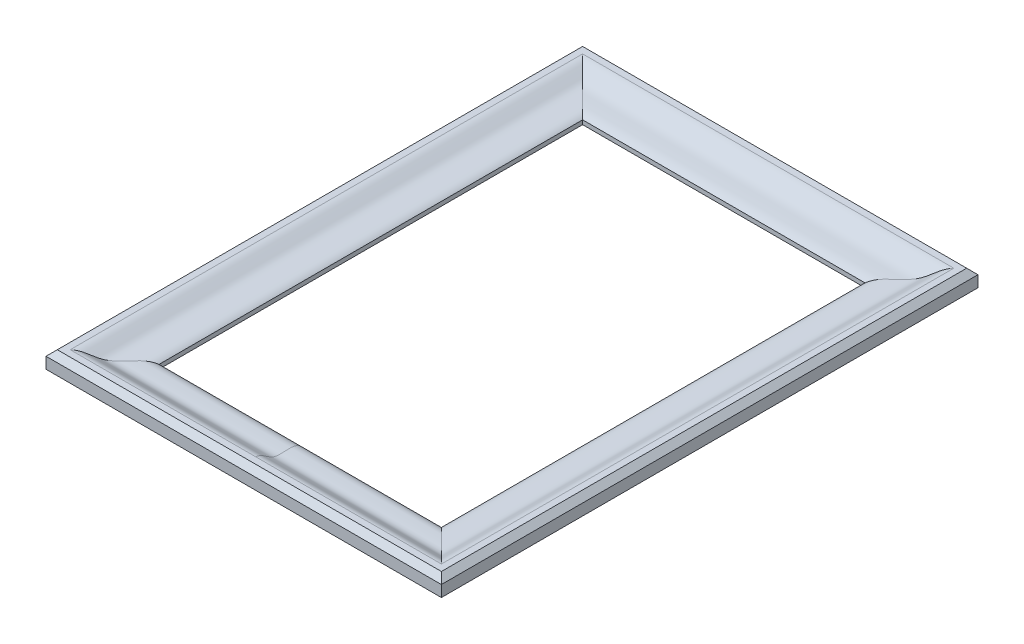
ISO-10303-21;
HEADER;
FILE_DESCRIPTION(('STEP AP214'),'2;1');
FILE_NAME('part.step','',(''),(''),'','','');
FILE_SCHEMA(('AUTOMOTIVE_DESIGN { 1 0 10303 214 1 1 1 1 }'));
ENDSEC;
DATA;
#1=APPLICATION_CONTEXT('core data for automotive mechanical design processes');
#2=APPLICATION_PROTOCOL_DEFINITION('international standard','automotive_design',2000,#1);
#3=PRODUCT_CONTEXT('',#1,'mechanical');
#4=PRODUCT('Part','Part','',(#3));
#5=PRODUCT_RELATED_PRODUCT_CATEGORY('part','',(#4));
#6=PRODUCT_DEFINITION_FORMATION('','',#4);
#7=PRODUCT_DEFINITION_CONTEXT('part definition',#1,'design');
#8=PRODUCT_DEFINITION('design','',#6,#7);
#9=PRODUCT_DEFINITION_SHAPE('','',#8);
#10=(LENGTH_UNIT() NAMED_UNIT(*) SI_UNIT(.MILLI.,.METRE.));
#11=(NAMED_UNIT(*) PLANE_ANGLE_UNIT() SI_UNIT($,.RADIAN.));
#12=(NAMED_UNIT(*) SI_UNIT($,.STERADIAN.) SOLID_ANGLE_UNIT());
#13=UNCERTAINTY_MEASURE_WITH_UNIT(LENGTH_MEASURE(1.E-05),#10,'distance_accuracy_value','');
#14=(GEOMETRIC_REPRESENTATION_CONTEXT(3) GLOBAL_UNCERTAINTY_ASSIGNED_CONTEXT((#13)) GLOBAL_UNIT_ASSIGNED_CONTEXT((#10,
#11,#12)) REPRESENTATION_CONTEXT('',''));
#15=CARTESIAN_POINT('',(0.,0.,0.));
#16=DIRECTION('',(0.,0.,1.));
#17=DIRECTION('',(1.,0.,0.));
#18=AXIS2_PLACEMENT_3D('',#15,#16,#17);
#19=CARTESIAN_POINT('',(0.,1.49398782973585,0.));
#20=DIRECTION('',(0.,0.,-1.));
#21=DIRECTION('',(0.,-1.,0.));
#22=AXIS2_PLACEMENT_3D('',#19,#20,#21);
#23=PLANE('',#22);
#24=DIRECTION('',(-1.,0.,0.));
#25=VECTOR('',#24,1.);
#26=CARTESIAN_POINT('',(-25.,1.49398782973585,0.));
#27=LINE('',#26,#25);
#28=CARTESIAN_POINT('',(0.,1.49398782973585,0.));
#29=VERTEX_POINT('',#28);
#30=CARTESIAN_POINT('',(-50.,1.49398782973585,0.));
#31=VERTEX_POINT('',#30);
#32=EDGE_CURVE('E224',#29,#31,#27,.T.);
#33=ORIENTED_EDGE('',*,*,#32,.F.);
#34=DIRECTION('',(-1.,0.,0.));
#35=VECTOR('',#34,1.);
#36=CARTESIAN_POINT('',(25.,1.49398782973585,0.));
#37=LINE('',#36,#35);
#38=CARTESIAN_POINT('',(50.,1.49398782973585,0.));
#39=VERTEX_POINT('',#38);
#40=EDGE_CURVE('E217',#39,#29,#37,.T.);
#41=ORIENTED_EDGE('',*,*,#40,.F.);
#42=DIRECTION('',(0.,-1.,0.));
#43=VECTOR('',#42,1.);
#44=CARTESIAN_POINT('',(50.,0.746993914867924,0.));
#45=LINE('',#44,#43);
#46=CARTESIAN_POINT('',(50.,0.,0.));
#47=VERTEX_POINT('',#46);
#48=EDGE_CURVE('E194',#39,#47,#45,.T.);
#49=ORIENTED_EDGE('',*,*,#48,.T.);
#50=DIRECTION('',(-1.,0.,0.));
#51=VECTOR('',#50,1.);
#52=CARTESIAN_POINT('',(-25.,0.,0.));
#53=LINE('',#52,#51);
#54=CARTESIAN_POINT('',(-50.,0.,0.));
#55=VERTEX_POINT('',#54);
#56=EDGE_CURVE('E303',#47,#55,#53,.T.);
#57=ORIENTED_EDGE('',*,*,#56,.T.);
#58=DIRECTION('',(0.,-1.,0.));
#59=VECTOR('',#58,1.);
#60=CARTESIAN_POINT('',(-50.,0.746993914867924,0.));
#61=LINE('',#60,#59);
#62=EDGE_CURVE('E296',#31,#55,#61,.T.);
#63=ORIENTED_EDGE('',*,*,#62,.F.);
#64=EDGE_LOOP('',(#33,#41,#49,#57,#63));
#65=FACE_BOUND('',#64,.T.);
#66=ADVANCED_FACE('F95',(#65),#23,.T.);
#67=CARTESIAN_POINT('',(0.,0.,0.));
#68=DIRECTION('',(0.,-1.,0.));
#69=DIRECTION('',(0.,0.,1.));
#70=AXIS2_PLACEMENT_3D('',#67,#68,#69);
#71=PLANE('',#70);
#72=DIRECTION('',(1.,0.,0.));
#73=VECTOR('',#72,1.);
#74=CARTESIAN_POINT('',(0.,0.,-170.));
#75=LINE('',#74,#73);
#76=CARTESIAN_POINT('',(-70.,0.,-170.));
#77=VERTEX_POINT('',#76);
#78=CARTESIAN_POINT('',(70.,0.,-170.));
#79=VERTEX_POINT('',#78);
#80=EDGE_CURVE('E255',#77,#79,#75,.T.);
#81=ORIENTED_EDGE('',*,*,#80,.T.);
#82=DIRECTION('',(0.,0.,1.));
#83=VECTOR('',#82,1.);
#84=CARTESIAN_POINT('',(70.,0.,-75.));
#85=LINE('',#84,#83);
#86=CARTESIAN_POINT('',(70.,0.,20.));
#87=VERTEX_POINT('',#86);
#88=EDGE_CURVE('E236',#79,#87,#85,.T.);
#89=ORIENTED_EDGE('',*,*,#88,.T.);
#90=DIRECTION('',(-1.,0.,0.));
#91=VECTOR('',#90,1.);
#92=CARTESIAN_POINT('',(-35.,0.,20.));
#93=LINE('',#92,#91);
#94=CARTESIAN_POINT('',(-70.,0.,20.));
#95=VERTEX_POINT('',#94);
#96=EDGE_CURVE('E305',#87,#95,#93,.T.);
#97=ORIENTED_EDGE('',*,*,#96,.T.);
#98=DIRECTION('',(0.,0.,-1.));
#99=VECTOR('',#98,1.);
#100=CARTESIAN_POINT('',(-70.,0.,-75.));
#101=LINE('',#100,#99);
#102=EDGE_CURVE('E277',#95,#77,#101,.T.);
#103=ORIENTED_EDGE('',*,*,#102,.T.);
#104=EDGE_LOOP('',(#81,#89,#97,#103));
#105=FACE_BOUND('',#104,.T.);
#106=ORIENTED_EDGE('',*,*,#56,.F.);
#107=DIRECTION('',(0.,0.,1.));
#108=VECTOR('',#107,1.);
#109=CARTESIAN_POINT('',(50.,0.,-75.));
#110=LINE('',#109,#108);
#111=CARTESIAN_POINT('',(50.,0.,-150.));
#112=VERTEX_POINT('',#111);
#113=EDGE_CURVE('E200',#112,#47,#110,.T.);
#114=ORIENTED_EDGE('',*,*,#113,.F.);
#115=DIRECTION('',(1.,0.,0.));
#116=VECTOR('',#115,1.);
#117=CARTESIAN_POINT('',(0.,0.,-150.));
#118=LINE('',#117,#116);
#119=CARTESIAN_POINT('',(-50.,0.,-150.));
#120=VERTEX_POINT('',#119);
#121=EDGE_CURVE('E253',#120,#112,#118,.T.);
#122=ORIENTED_EDGE('',*,*,#121,.F.);
#123=DIRECTION('',(0.,0.,-1.));
#124=VECTOR('',#123,1.);
#125=CARTESIAN_POINT('',(-50.,0.,-75.));
#126=LINE('',#125,#124);
#127=EDGE_CURVE('E275',#55,#120,#126,.T.);
#128=ORIENTED_EDGE('',*,*,#127,.F.);
#129=EDGE_LOOP('',(#106,#114,#122,#128));
#130=FACE_BOUND('',#129,.T.);
#131=ADVANCED_FACE('F353',(#105,#130),#71,.T.);
#132=CARTESIAN_POINT('',(0.,0.,20.));
#133=DIRECTION('',(0.,0.,1.));
#134=DIRECTION('',(0.,1.,0.));
#135=AXIS2_PLACEMENT_3D('',#132,#133,#134);
#136=PLANE('',#135);
#137=DIRECTION('',(0.,1.,0.));
#138=VECTOR('',#137,1.);
#139=CARTESIAN_POINT('',(70.,3.,20.));
#140=LINE('',#139,#138);
#141=CARTESIAN_POINT('',(70.,3.99999999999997,20.));
#142=VERTEX_POINT('',#141);
#143=EDGE_CURVE('E239',#87,#142,#140,.T.);
#144=ORIENTED_EDGE('',*,*,#143,.T.);
#145=DIRECTION('',(-1.,0.,0.));
#146=VECTOR('',#145,1.);
#147=CARTESIAN_POINT('',(0.,3.99999999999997,20.));
#148=LINE('',#147,#146);
#149=CARTESIAN_POINT('',(-70.,3.99999999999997,20.));
#150=VERTEX_POINT('',#149);
#151=EDGE_CURVE('E302',#142,#150,#148,.T.);
#152=ORIENTED_EDGE('',*,*,#151,.T.);
#153=DIRECTION('',(0.,1.,0.));
#154=VECTOR('',#153,1.);
#155=CARTESIAN_POINT('',(-70.,3.,20.));
#156=LINE('',#155,#154);
#157=EDGE_CURVE('E307',#95,#150,#156,.T.);
#158=ORIENTED_EDGE('',*,*,#157,.F.);
#159=ORIENTED_EDGE('',*,*,#96,.F.);
#160=EDGE_LOOP('',(#144,#152,#158,#159));
#161=FACE_BOUND('',#160,.T.);
#162=ADVANCED_FACE('F349',(#161),#136,.T.);
#163=CARTESIAN_POINT('',(0.,6.,20.));
#164=DIRECTION('',(0.,1.,0.));
#165=DIRECTION('',(0.,0.,-1.));
#166=AXIS2_PLACEMENT_3D('',#163,#164,#165);
#167=PLANE('',#166);
#168=DIRECTION('',(0.,0.,1.));
#169=VECTOR('',#168,1.);
#170=CARTESIAN_POINT('',(-67.9999999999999,6.,20.));
#171=LINE('',#170,#169);
#172=CARTESIAN_POINT('',(-67.9999999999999,6.00000000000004,-168.));
#173=VERTEX_POINT('',#172);
#174=CARTESIAN_POINT('',(-67.9999999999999,6.,17.9999999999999));
#175=VERTEX_POINT('',#174);
#176=EDGE_CURVE('E319',#173,#175,#171,.T.);
#177=ORIENTED_EDGE('',*,*,#176,.T.);
#178=DIRECTION('',(1.,0.,0.));
#179=VECTOR('',#178,1.);
#180=CARTESIAN_POINT('',(0.,6.,17.9999999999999));
#181=LINE('',#180,#179);
#182=CARTESIAN_POINT('',(68.,6.,17.9999999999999));
#183=VERTEX_POINT('',#182);
#184=EDGE_CURVE('E321',#175,#183,#181,.T.);
#185=ORIENTED_EDGE('',*,*,#184,.T.);
#186=DIRECTION('',(0.,0.,-1.));
#187=VECTOR('',#186,1.);
#188=CARTESIAN_POINT('',(68.,6.,20.));
#189=LINE('',#188,#187);
#190=CARTESIAN_POINT('',(68.,6.00000000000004,-168.));
#191=VERTEX_POINT('',#190);
#192=EDGE_CURVE('E315',#183,#191,#189,.T.);
#193=ORIENTED_EDGE('',*,*,#192,.T.);
#194=DIRECTION('',(-1.,0.,0.));
#195=VECTOR('',#194,1.);
#196=CARTESIAN_POINT('',(0.,6.00000000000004,-168.));
#197=LINE('',#196,#195);
#198=EDGE_CURVE('E317',#191,#173,#197,.T.);
#199=ORIENTED_EDGE('',*,*,#198,.T.);
#200=EDGE_LOOP('',(#177,#185,#193,#199));
#201=FACE_BOUND('',#200,.T.);
#202=DIRECTION('',(1.,0.,0.));
#203=VECTOR('',#202,1.);
#204=CARTESIAN_POINT('',(0.,6.,-165.71403392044));
#205=LINE('',#204,#203);
#206=CARTESIAN_POINT('',(-65.7140339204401,6.,-165.71403392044));
#207=VERTEX_POINT('',#206);
#208=CARTESIAN_POINT('',(65.71403392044,6.,-165.71403392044));
#209=VERTEX_POINT('',#208);
#210=EDGE_CURVE('E259',#207,#209,#205,.T.);
#211=ORIENTED_EDGE('',*,*,#210,.T.);
#212=DIRECTION('',(0.,0.,1.));
#213=VECTOR('',#212,1.);
#214=CARTESIAN_POINT('',(65.71403392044,6.,-75.));
#215=LINE('',#214,#213);
#216=CARTESIAN_POINT('',(65.71403392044,6.,15.71403392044));
#217=VERTEX_POINT('',#216);
#218=EDGE_CURVE('E212',#209,#217,#215,.T.);
#219=ORIENTED_EDGE('',*,*,#218,.T.);
#220=DIRECTION('',(-1.,0.,0.));
#221=VECTOR('',#220,1.);
#222=CARTESIAN_POINT('',(32.85701696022,6.,15.71403392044));
#223=LINE('',#222,#221);
#224=CARTESIAN_POINT('',(0.,6.,15.71403392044));
#225=VERTEX_POINT('',#224);
#226=EDGE_CURVE('E220',#217,#225,#223,.T.);
#227=ORIENTED_EDGE('',*,*,#226,.T.);
#228=DIRECTION('',(-1.,0.,0.));
#229=VECTOR('',#228,1.);
#230=CARTESIAN_POINT('',(-32.85701696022,6.,15.7140339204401));
#231=LINE('',#230,#229);
#232=CARTESIAN_POINT('',(-65.7140339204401,6.,15.7140339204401));
#233=VERTEX_POINT('',#232);
#234=EDGE_CURVE('E309',#225,#233,#231,.T.);
#235=ORIENTED_EDGE('',*,*,#234,.T.);
#236=DIRECTION('',(0.,0.,-1.));
#237=VECTOR('',#236,1.);
#238=CARTESIAN_POINT('',(-65.7140339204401,6.,-75.));
#239=LINE('',#238,#237);
#240=EDGE_CURVE('E281',#233,#207,#239,.T.);
#241=ORIENTED_EDGE('',*,*,#240,.T.);
#242=EDGE_LOOP('',(#211,#219,#227,#235,#241));
#243=FACE_BOUND('',#242,.T.);
#244=ADVANCED_FACE('F385',(#201,#243),#167,.T.);
#245=CARTESIAN_POINT('',(0.,6.,15.7140339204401));
#246=CARTESIAN_POINT('',(-65.7140339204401,6.,15.7140339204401));
#247=CARTESIAN_POINT('',(0.,5.93123962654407,14.1947357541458));
#248=CARTESIAN_POINT('',(-64.1947357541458,5.93123962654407,14.1947357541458));
#249=CARTESIAN_POINT('',(0.,4.4720479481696,12.2966162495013));
#250=CARTESIAN_POINT('',(-62.2966162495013,4.4720479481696,12.2966162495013));
#251=CARTESIAN_POINT('',(0.,1.34243259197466,7.59293094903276));
#252=CARTESIAN_POINT('',(-57.5929309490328,1.34243259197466,7.59293094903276));
#253=CARTESIAN_POINT('',(0.,3.73260147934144,2.76388780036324));
#254=CARTESIAN_POINT('',(-52.7638878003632,3.73260147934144,2.76388780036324));
#255=CARTESIAN_POINT('',(0.,1.49398782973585,0.));
#256=CARTESIAN_POINT('',(-50.,1.49398782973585,0.));
#257=B_SPLINE_SURFACE_WITH_KNOTS('',3,1,((#245,#246),(#247,#248),(#249,#250),(#251,#252),(#253,
#254),(#255,#256)),.UNSPECIFIED.,.F.,.F.,.F.,(4,1,1,4),(2,2),(0.646903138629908,
0.739777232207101,0.790788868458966,1.),(0.,1.),.UNSPECIFIED.);
#258=CARTESIAN_POINT('',(0.,6.,15.7140339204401));
#259=CARTESIAN_POINT('',(0.,5.93123962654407,14.1947357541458));
#260=CARTESIAN_POINT('',(0.,4.4720479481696,12.2966162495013));
#261=CARTESIAN_POINT('',(0.,1.34243259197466,7.59293094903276));
#262=CARTESIAN_POINT('',(0.,3.73260147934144,2.76388780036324));
#263=CARTESIAN_POINT('',(0.,1.49398782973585,0.));
#264=B_SPLINE_CURVE_WITH_KNOTS('',3,(#258,#259,#260,#261,#262,#263),.UNSPECIFIED.,.F.,.F.,(4,1,
1,4),(0.646903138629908,0.739777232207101,0.790788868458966,1.),.UNSPECIFIED.);
#265=EDGE_CURVE('E274',#225,#29,#264,.T.);
#266=CARTESIAN_POINT('',(-65.7140339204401,6.,15.7140339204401));
#267=CARTESIAN_POINT('',(-64.1947357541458,5.93123962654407,14.1947357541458));
#268=CARTESIAN_POINT('',(-62.2966162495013,4.4720479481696,12.2966162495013));
#269=CARTESIAN_POINT('',(-57.5929309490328,1.34243259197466,7.59293094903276));
#270=CARTESIAN_POINT('',(-52.7638878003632,3.73260147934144,2.76388780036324));
#271=CARTESIAN_POINT('',(-50.,1.49398782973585,0.));
#272=B_SPLINE_CURVE_WITH_KNOTS('',3,(#266,#267,#268,#269,#270,#271),.UNSPECIFIED.,.F.,.F.,(4,1,
1,4),(0.646903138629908,0.739777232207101,0.790788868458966,1.),.UNSPECIFIED.);
#273=EDGE_CURVE('E288',#233,#31,#272,.T.);
#274=ORIENTED_EDGE('',*,*,#265,.T.);
#275=ORIENTED_EDGE('',*,*,#32,.T.);
#276=ORIENTED_EDGE('',*,*,#273,.F.);
#277=ORIENTED_EDGE('',*,*,#234,.F.);
#278=EDGE_LOOP('',(#274,#275,#276,#277));
#279=FACE_BOUND('',#278,.T.);
#280=ADVANCED_FACE('F378',(#279),#257,.T.);
#281=CARTESIAN_POINT('',(-50.,1.49398782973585,0.));
#282=DIRECTION('',(1.,0.,0.));
#283=DIRECTION('',(0.,-1.,0.));
#284=AXIS2_PLACEMENT_3D('',#281,#282,#283);
#285=PLANE('',#284);
#286=ORIENTED_EDGE('',*,*,#62,.T.);
#287=ORIENTED_EDGE('',*,*,#127,.T.);
#288=DIRECTION('',(0.,-1.,0.));
#289=VECTOR('',#288,1.);
#290=CARTESIAN_POINT('',(-50.,0.746993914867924,-150.));
#291=LINE('',#290,#289);
#292=CARTESIAN_POINT('',(-50.,1.49398782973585,-150.));
#293=VERTEX_POINT('',#292);
#294=EDGE_CURVE('E268',#293,#120,#291,.T.);
#295=ORIENTED_EDGE('',*,*,#294,.F.);
#296=DIRECTION('',(0.,0.,-1.));
#297=VECTOR('',#296,1.);
#298=CARTESIAN_POINT('',(-50.,1.49398782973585,-75.));
#299=LINE('',#298,#297);
#300=EDGE_CURVE('E267',#31,#293,#299,.T.);
#301=ORIENTED_EDGE('',*,*,#300,.F.);
#302=EDGE_LOOP('',(#286,#287,#295,#301));
#303=FACE_BOUND('',#302,.T.);
#304=ADVANCED_FACE('F473',(#303),#285,.T.);
#305=CARTESIAN_POINT('',(-70.,0.,20.));
#306=DIRECTION('',(-1.,0.,0.));
#307=DIRECTION('',(0.,1.,0.));
#308=AXIS2_PLACEMENT_3D('',#305,#306,#307);
#309=PLANE('',#308);
#310=ORIENTED_EDGE('',*,*,#157,.T.);
#311=DIRECTION('',(0.,0.,-1.));
#312=VECTOR('',#311,1.);
#313=CARTESIAN_POINT('',(-70.,3.99999999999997,20.));
#314=LINE('',#313,#312);
#315=CARTESIAN_POINT('',(-70.,4.00000000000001,-170.));
#316=VERTEX_POINT('',#315);
#317=EDGE_CURVE('E119',#150,#316,#314,.T.);
#318=ORIENTED_EDGE('',*,*,#317,.T.);
#319=DIRECTION('',(0.,1.,0.));
#320=VECTOR('',#319,1.);
#321=CARTESIAN_POINT('',(-70.,3.,-170.));
#322=LINE('',#321,#320);
#323=EDGE_CURVE('E279',#77,#316,#322,.T.);
#324=ORIENTED_EDGE('',*,*,#323,.F.);
#325=ORIENTED_EDGE('',*,*,#102,.F.);
#326=EDGE_LOOP('',(#310,#318,#324,#325));
#327=FACE_BOUND('',#326,.T.);
#328=ADVANCED_FACE('F469',(#327),#309,.T.);
#329=CARTESIAN_POINT('',(-65.7140339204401,6.,15.7140339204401));
#330=CARTESIAN_POINT('',(-65.7140339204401,6.,-165.71403392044));
#331=CARTESIAN_POINT('',(-64.1947357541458,5.93123962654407,14.1947357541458));
#332=CARTESIAN_POINT('',(-64.1947357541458,5.93123962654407,-164.194735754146));
#333=CARTESIAN_POINT('',(-62.2966162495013,4.4720479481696,12.2966162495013));
#334=CARTESIAN_POINT('',(-62.2966162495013,4.4720479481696,-162.296616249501));
#335=CARTESIAN_POINT('',(-57.5929309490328,1.34243259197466,7.59293094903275));
#336=CARTESIAN_POINT('',(-57.5929309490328,1.34243259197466,-157.592930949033));
#337=CARTESIAN_POINT('',(-52.7638878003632,3.73260147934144,2.76388780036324));
#338=CARTESIAN_POINT('',(-52.7638878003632,3.73260147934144,-152.763887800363));
#339=CARTESIAN_POINT('',(-50.,1.49398782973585,0.));
#340=CARTESIAN_POINT('',(-50.,1.49398782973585,-150.));
#341=B_SPLINE_SURFACE_WITH_KNOTS('',3,1,((#329,#330),(#331,#332),(#333,#334),(#335,#336),(#337,
#338),(#339,#340)),.UNSPECIFIED.,.F.,.F.,.F.,(4,1,1,4),(2,2),(0.630508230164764,
0.727694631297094,0.781074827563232,1.),(0.,1.),.UNSPECIFIED.);
#342=CARTESIAN_POINT('',(-65.7140339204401,6.,-165.71403392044));
#343=CARTESIAN_POINT('',(-64.1947357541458,5.93123962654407,-164.194735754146));
#344=CARTESIAN_POINT('',(-62.2966162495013,4.4720479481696,-162.296616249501));
#345=CARTESIAN_POINT('',(-57.5929309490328,1.34243259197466,-157.592930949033));
#346=CARTESIAN_POINT('',(-52.7638878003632,3.73260147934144,-152.763887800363));
#347=CARTESIAN_POINT('',(-50.,1.49398782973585,-150.));
#348=B_SPLINE_CURVE_WITH_KNOTS('',3,(#342,#343,#344,#345,#346,#347),.UNSPECIFIED.,.F.,.F.,(4,1,
1,4),(0.630508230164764,0.727694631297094,0.781074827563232,1.),.UNSPECIFIED.);
#349=EDGE_CURVE('E252',#207,#293,#348,.T.);
#350=ORIENTED_EDGE('',*,*,#273,.T.);
#351=ORIENTED_EDGE('',*,*,#300,.T.);
#352=ORIENTED_EDGE('',*,*,#349,.F.);
#353=ORIENTED_EDGE('',*,*,#240,.F.);
#354=EDGE_LOOP('',(#350,#351,#352,#353));
#355=FACE_BOUND('',#354,.T.);
#356=ADVANCED_FACE('F367',(#355),#341,.T.);
#357=CARTESIAN_POINT('',(-50.,1.49398782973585,-150.));
#358=DIRECTION('',(0.,0.,1.));
#359=DIRECTION('',(0.,-1.,0.));
#360=AXIS2_PLACEMENT_3D('',#357,#358,#359);
#361=PLANE('',#360);
#362=ORIENTED_EDGE('',*,*,#294,.T.);
#363=ORIENTED_EDGE('',*,*,#121,.T.);
#364=DIRECTION('',(0.,-1.,0.));
#365=VECTOR('',#364,1.);
#366=CARTESIAN_POINT('',(50.,0.746993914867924,-150.));
#367=LINE('',#366,#365);
#368=CARTESIAN_POINT('',(50.,1.49398782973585,-150.));
#369=VERTEX_POINT('',#368);
#370=EDGE_CURVE('E247',#369,#112,#367,.T.);
#371=ORIENTED_EDGE('',*,*,#370,.F.);
#372=DIRECTION('',(1.,0.,0.));
#373=VECTOR('',#372,1.);
#374=CARTESIAN_POINT('',(0.,1.49398782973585,-150.));
#375=LINE('',#374,#373);
#376=EDGE_CURVE('E246',#293,#369,#375,.T.);
#377=ORIENTED_EDGE('',*,*,#376,.F.);
#378=EDGE_LOOP('',(#362,#363,#371,#377));
#379=FACE_BOUND('',#378,.T.);
#380=ADVANCED_FACE('F359',(#379),#361,.T.);
#381=CARTESIAN_POINT('',(-70.,0.,-170.));
#382=DIRECTION('',(0.,0.,-1.));
#383=DIRECTION('',(0.,1.,0.));
#384=AXIS2_PLACEMENT_3D('',#381,#382,#383);
#385=PLANE('',#384);
#386=ORIENTED_EDGE('',*,*,#323,.T.);
#387=DIRECTION('',(1.,0.,0.));
#388=VECTOR('',#387,1.);
#389=CARTESIAN_POINT('',(-70.,4.00000000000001,-170.));
#390=LINE('',#389,#388);
#391=CARTESIAN_POINT('',(70.,4.00000000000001,-170.));
#392=VERTEX_POINT('',#391);
#393=EDGE_CURVE('E104',#316,#392,#390,.T.);
#394=ORIENTED_EDGE('',*,*,#393,.T.);
#395=DIRECTION('',(0.,1.,0.));
#396=VECTOR('',#395,1.);
#397=CARTESIAN_POINT('',(70.,3.,-170.));
#398=LINE('',#397,#396);
#399=EDGE_CURVE('E257',#79,#392,#398,.T.);
#400=ORIENTED_EDGE('',*,*,#399,.F.);
#401=ORIENTED_EDGE('',*,*,#80,.F.);
#402=EDGE_LOOP('',(#386,#394,#400,#401));
#403=FACE_BOUND('',#402,.T.);
#404=ADVANCED_FACE('F356',(#403),#385,.T.);
#405=CARTESIAN_POINT('',(-65.71403392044,6.,-165.71403392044));
#406=CARTESIAN_POINT('',(65.71403392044,6.,-165.71403392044));
#407=CARTESIAN_POINT('',(-64.1947357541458,5.93123962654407,-164.194735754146));
#408=CARTESIAN_POINT('',(64.1947357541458,5.93123962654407,-164.194735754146));
#409=CARTESIAN_POINT('',(-62.2966162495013,4.4720479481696,-162.296616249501));
#410=CARTESIAN_POINT('',(62.2966162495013,4.4720479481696,-162.296616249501));
#411=CARTESIAN_POINT('',(-57.5929309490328,1.34243259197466,-157.592930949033));
#412=CARTESIAN_POINT('',(57.5929309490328,1.34243259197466,-157.592930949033));
#413=CARTESIAN_POINT('',(-52.7638878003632,3.73260147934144,-152.763887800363));
#414=CARTESIAN_POINT('',(52.7638878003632,3.73260147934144,-152.763887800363));
#415=CARTESIAN_POINT('',(-50.,1.49398782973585,-150.));
#416=CARTESIAN_POINT('',(50.,1.49398782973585,-150.));
#417=B_SPLINE_SURFACE_WITH_KNOTS('',3,1,((#405,#406),(#407,#408),(#409,#410),(#411,#412),(#413,
#414),(#415,#416)),.UNSPECIFIED.,.F.,.F.,.F.,(4,1,1,4),(2,2),(0.630508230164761,
0.727694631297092,0.78107482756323,1.),(0.,1.),.UNSPECIFIED.);
#418=CARTESIAN_POINT('',(65.71403392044,6.,-165.71403392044));
#419=CARTESIAN_POINT('',(64.1947357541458,5.93123962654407,-164.194735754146));
#420=CARTESIAN_POINT('',(62.2966162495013,4.4720479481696,-162.296616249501));
#421=CARTESIAN_POINT('',(57.5929309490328,1.34243259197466,-157.592930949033));
#422=CARTESIAN_POINT('',(52.7638878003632,3.73260147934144,-152.763887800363));
#423=CARTESIAN_POINT('',(50.,1.49398782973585,-150.));
#424=B_SPLINE_CURVE_WITH_KNOTS('',3,(#418,#419,#420,#421,#422,#423),.UNSPECIFIED.,.F.,.F.,(4,1,
1,4),(0.630508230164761,0.727694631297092,0.78107482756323,1.),.UNSPECIFIED.);
#425=EDGE_CURVE('E203',#209,#369,#424,.T.);
#426=ORIENTED_EDGE('',*,*,#349,.T.);
#427=ORIENTED_EDGE('',*,*,#376,.T.);
#428=ORIENTED_EDGE('',*,*,#425,.F.);
#429=ORIENTED_EDGE('',*,*,#210,.F.);
#430=EDGE_LOOP('',(#426,#427,#428,#429));
#431=FACE_BOUND('',#430,.T.);
#432=ADVANCED_FACE('F358',(#431),#417,.T.);
#433=CARTESIAN_POINT('',(50.,1.49398782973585,-150.));
#434=DIRECTION('',(-1.,0.,0.));
#435=DIRECTION('',(0.,-1.,0.));
#436=AXIS2_PLACEMENT_3D('',#433,#434,#435);
#437=PLANE('',#436);
#438=ORIENTED_EDGE('',*,*,#370,.T.);
#439=ORIENTED_EDGE('',*,*,#113,.T.);
#440=ORIENTED_EDGE('',*,*,#48,.F.);
#441=DIRECTION('',(0.,0.,1.));
#442=VECTOR('',#441,1.);
#443=CARTESIAN_POINT('',(50.,1.49398782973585,-75.));
#444=LINE('',#443,#442);
#445=EDGE_CURVE('E198',#369,#39,#444,.T.);
#446=ORIENTED_EDGE('',*,*,#445,.F.);
#447=EDGE_LOOP('',(#438,#439,#440,#446));
#448=FACE_BOUND('',#447,.T.);
#449=ADVANCED_FACE('F197',(#448),#437,.T.);
#450=CARTESIAN_POINT('',(70.,0.,-170.));
#451=DIRECTION('',(1.,0.,0.));
#452=DIRECTION('',(0.,1.,0.));
#453=AXIS2_PLACEMENT_3D('',#450,#451,#452);
#454=PLANE('',#453);
#455=ORIENTED_EDGE('',*,*,#399,.T.);
#456=DIRECTION('',(0.,0.,1.));
#457=VECTOR('',#456,1.);
#458=CARTESIAN_POINT('',(70.,4.00000000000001,-170.));
#459=LINE('',#458,#457);
#460=EDGE_CURVE('E12',#392,#142,#459,.T.);
#461=ORIENTED_EDGE('',*,*,#460,.T.);
#462=ORIENTED_EDGE('',*,*,#143,.F.);
#463=ORIENTED_EDGE('',*,*,#88,.F.);
#464=EDGE_LOOP('',(#455,#461,#462,#463));
#465=FACE_BOUND('',#464,.T.);
#466=ADVANCED_FACE('F346',(#465),#454,.T.);
#467=CARTESIAN_POINT('',(65.71403392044,6.,-165.71403392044));
#468=CARTESIAN_POINT('',(65.71403392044,6.,15.71403392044));
#469=CARTESIAN_POINT('',(64.1947357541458,5.93123962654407,-164.194735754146));
#470=CARTESIAN_POINT('',(64.1947357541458,5.93123962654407,14.1947357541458));
#471=CARTESIAN_POINT('',(62.2966162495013,4.4720479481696,-162.296616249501));
#472=CARTESIAN_POINT('',(62.2966162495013,4.4720479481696,12.2966162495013));
#473=CARTESIAN_POINT('',(57.5929309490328,1.34243259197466,-157.592930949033));
#474=CARTESIAN_POINT('',(57.5929309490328,1.34243259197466,7.59293094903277));
#475=CARTESIAN_POINT('',(52.7638878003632,3.73260147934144,-152.763887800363));
#476=CARTESIAN_POINT('',(52.7638878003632,3.73260147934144,2.76388780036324));
#477=CARTESIAN_POINT('',(50.,1.49398782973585,-150.));
#478=CARTESIAN_POINT('',(50.,1.49398782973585,0.));
#479=B_SPLINE_SURFACE_WITH_KNOTS('',3,1,((#467,#468),(#469,#470),(#471,#472),(#473,#474),(#475,
#476),(#477,#478)),.UNSPECIFIED.,.F.,.F.,.F.,(4,1,1,4),(2,2),(0.630508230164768,
0.727694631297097,0.781074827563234,1.),(0.,1.),.UNSPECIFIED.);
#480=CARTESIAN_POINT('',(65.71403392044,6.,15.71403392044));
#481=CARTESIAN_POINT('',(64.1947357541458,5.93123962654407,14.1947357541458));
#482=CARTESIAN_POINT('',(62.2966162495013,4.4720479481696,12.2966162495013));
#483=CARTESIAN_POINT('',(57.5929309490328,1.34243259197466,7.59293094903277));
#484=CARTESIAN_POINT('',(52.7638878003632,3.73260147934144,2.76388780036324));
#485=CARTESIAN_POINT('',(50.,1.49398782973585,0.));
#486=B_SPLINE_CURVE_WITH_KNOTS('',3,(#480,#481,#482,#483,#484,#485),.UNSPECIFIED.,.F.,.F.,(4,1,
1,4),(0.630508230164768,0.727694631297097,0.781074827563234,1.),.UNSPECIFIED.);
#487=EDGE_CURVE('E210',#217,#39,#486,.T.);
#488=ORIENTED_EDGE('',*,*,#425,.T.);
#489=ORIENTED_EDGE('',*,*,#445,.T.);
#490=ORIENTED_EDGE('',*,*,#487,.F.);
#491=ORIENTED_EDGE('',*,*,#218,.F.);
#492=EDGE_LOOP('',(#488,#489,#490,#491));
#493=FACE_BOUND('',#492,.T.);
#494=ADVANCED_FACE('F208',(#493),#479,.T.);
#495=CARTESIAN_POINT('',(65.71403392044,6.,15.71403392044));
#496=CARTESIAN_POINT('',(0.,6.,15.71403392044));
#497=CARTESIAN_POINT('',(64.1947357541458,5.93123962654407,14.1947357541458));
#498=CARTESIAN_POINT('',(0.,5.93123962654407,14.1947357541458));
#499=CARTESIAN_POINT('',(62.2966162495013,4.4720479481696,12.2966162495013));
#500=CARTESIAN_POINT('',(0.,4.4720479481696,12.2966162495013));
#501=CARTESIAN_POINT('',(57.5929309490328,1.34243259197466,7.59293094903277));
#502=CARTESIAN_POINT('',(0.,1.34243259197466,7.59293094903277));
#503=CARTESIAN_POINT('',(52.7638878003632,3.73260147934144,2.76388780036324));
#504=CARTESIAN_POINT('',(0.,3.73260147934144,2.76388780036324));
#505=CARTESIAN_POINT('',(50.,1.49398782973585,0.));
#506=CARTESIAN_POINT('',(0.,1.49398782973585,0.));
#507=B_SPLINE_SURFACE_WITH_KNOTS('',3,1,((#495,#496),(#497,#498),(#499,#500),(#501,#502),(#503,
#504),(#505,#506)),.UNSPECIFIED.,.F.,.F.,.F.,(4,1,1,4),(2,2),(0.630508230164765,
0.727694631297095,0.781074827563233,1.),(0.,1.),.UNSPECIFIED.);
#508=ORIENTED_EDGE('',*,*,#487,.T.);
#509=ORIENTED_EDGE('',*,*,#40,.T.);
#510=ORIENTED_EDGE('',*,*,#265,.F.);
#511=ORIENTED_EDGE('',*,*,#226,.F.);
#512=EDGE_LOOP('',(#508,#509,#510,#511));
#513=FACE_BOUND('',#512,.T.);
#514=ADVANCED_FACE('F216',(#513),#507,.T.);
#515=CARTESIAN_POINT('',(-70.,4.00000000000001,-170.));
#516=DIRECTION('',(0.,-0.707106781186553,0.707106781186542));
#517=DIRECTION('',(1.,0.,0.));
#518=AXIS2_PLACEMENT_3D('',#515,#516,#517);
#519=PLANE('',#518);
#520=DIRECTION('',(0.577350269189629,0.57735026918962,0.577350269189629));
#521=VECTOR('',#520,1.);
#522=CARTESIAN_POINT('',(-70.,4.00000000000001,-170.));
#523=LINE('',#522,#521);
#524=EDGE_CURVE('E228',#173,#316,#523,.F.);
#525=ORIENTED_EDGE('',*,*,#524,.F.);
#526=ORIENTED_EDGE('',*,*,#198,.F.);
#527=DIRECTION('',(-0.577350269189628,0.57735026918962,0.577350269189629));
#528=VECTOR('',#527,1.);
#529=CARTESIAN_POINT('',(70.,4.00000000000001,-170.));
#530=LINE('',#529,#528);
#531=EDGE_CURVE('E99',#392,#191,#530,.T.);
#532=ORIENTED_EDGE('',*,*,#531,.F.);
#533=ORIENTED_EDGE('',*,*,#393,.F.);
#534=EDGE_LOOP('',(#525,#526,#532,#533));
#535=FACE_BOUND('',#534,.T.);
#536=ADVANCED_FACE('F97',(#535),#519,.F.);
#537=CARTESIAN_POINT('',(70.,4.00000000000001,-170.));
#538=DIRECTION('',(-0.707106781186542,-0.707106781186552,0.));
#539=DIRECTION('',(0.,0.,1.));
#540=AXIS2_PLACEMENT_3D('',#537,#538,#539);
#541=PLANE('',#540);
#542=ORIENTED_EDGE('',*,*,#531,.T.);
#543=ORIENTED_EDGE('',*,*,#192,.F.);
#544=DIRECTION('',(0.577350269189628,-0.57735026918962,0.57735026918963));
#545=VECTOR('',#544,1.);
#546=CARTESIAN_POINT('',(6.66666666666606,67.3333333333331,-43.3333333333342));
#547=LINE('',#546,#545);
#548=EDGE_CURVE('E328',#142,#183,#547,.F.);
#549=ORIENTED_EDGE('',*,*,#548,.F.);
#550=ORIENTED_EDGE('',*,*,#460,.F.);
#551=EDGE_LOOP('',(#542,#543,#549,#550));
#552=FACE_BOUND('',#551,.T.);
#553=ADVANCED_FACE('F342',(#552),#541,.F.);
#554=CARTESIAN_POINT('',(-70.,3.99999999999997,20.));
#555=DIRECTION('',(0.707106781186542,-0.707106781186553,0.));
#556=DIRECTION('',(0.,0.,-1.));
#557=AXIS2_PLACEMENT_3D('',#554,#555,#556);
#558=PLANE('',#557);
#559=ORIENTED_EDGE('',*,*,#524,.T.);
#560=ORIENTED_EDGE('',*,*,#317,.F.);
#561=DIRECTION('',(0.577350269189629,0.577350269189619,-0.577350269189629));
#562=VECTOR('',#561,1.);
#563=CARTESIAN_POINT('',(-70.,3.99999999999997,20.));
#564=LINE('',#563,#562);
#565=EDGE_CURVE('E326',#175,#150,#564,.F.);
#566=ORIENTED_EDGE('',*,*,#565,.F.);
#567=ORIENTED_EDGE('',*,*,#176,.F.);
#568=EDGE_LOOP('',(#559,#560,#566,#567));
#569=FACE_BOUND('',#568,.T.);
#570=ADVANCED_FACE('F333',(#569),#558,.F.);
#571=CARTESIAN_POINT('',(0.,3.99999999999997,20.));
#572=DIRECTION('',(0.,-0.707106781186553,-0.707106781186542));
#573=DIRECTION('',(-1.,0.,0.));
#574=AXIS2_PLACEMENT_3D('',#571,#572,#573);
#575=PLANE('',#574);
#576=ORIENTED_EDGE('',*,*,#548,.T.);
#577=ORIENTED_EDGE('',*,*,#184,.F.);
#578=ORIENTED_EDGE('',*,*,#565,.T.);
#579=ORIENTED_EDGE('',*,*,#151,.F.);
#580=EDGE_LOOP('',(#576,#577,#578,#579));
#581=FACE_BOUND('',#580,.T.);
#582=ADVANCED_FACE('F389',(#581),#575,.F.);
#583=CLOSED_SHELL('',(#66,#131,#162,#244,#280,#304,#328,#356,#380,#404,#432,#449,#466,#494,#514,
#536,#553,#570,#582));
#584=MANIFOLD_SOLID_BREP('B2',#583);
#585=ADVANCED_BREP_SHAPE_REPRESENTATION('',(#18,#584),#14);
#586=SHAPE_DEFINITION_REPRESENTATION(#9,#585);
ENDSEC;
END-ISO-10303-21;
